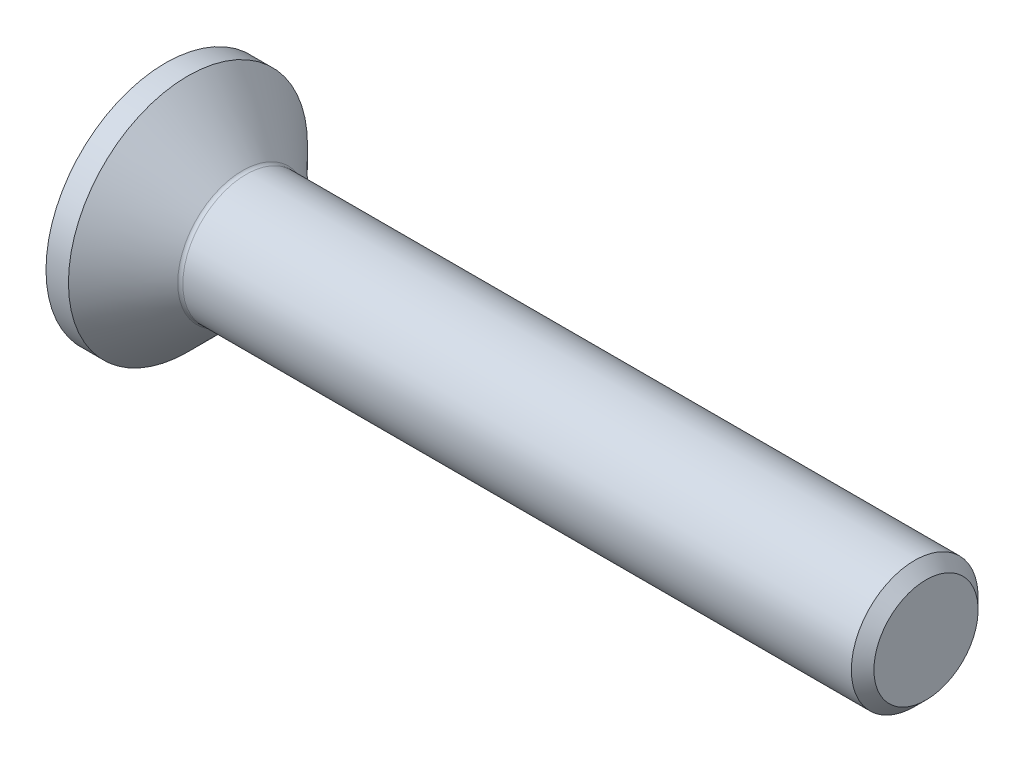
ISO-10303-21;
HEADER;
FILE_DESCRIPTION(('STEP AP214'),'2;1');
FILE_NAME('part.step','',(''),(''),'','','');
FILE_SCHEMA(('AUTOMOTIVE_DESIGN { 1 0 10303 214 1 1 1 1 }'));
ENDSEC;
DATA;
#1=APPLICATION_CONTEXT('core data for automotive mechanical design processes');
#2=APPLICATION_PROTOCOL_DEFINITION('international standard','automotive_design',2000,#1);
#3=PRODUCT_CONTEXT('',#1,'mechanical');
#4=PRODUCT('Part','Part','',(#3));
#5=PRODUCT_RELATED_PRODUCT_CATEGORY('part','',(#4));
#6=PRODUCT_DEFINITION_FORMATION('','',#4);
#7=PRODUCT_DEFINITION_CONTEXT('part definition',#1,'design');
#8=PRODUCT_DEFINITION('design','',#6,#7);
#9=PRODUCT_DEFINITION_SHAPE('','',#8);
#10=(LENGTH_UNIT() NAMED_UNIT(*) SI_UNIT(.MILLI.,.METRE.));
#11=(NAMED_UNIT(*) PLANE_ANGLE_UNIT() SI_UNIT($,.RADIAN.));
#12=(NAMED_UNIT(*) SI_UNIT($,.STERADIAN.) SOLID_ANGLE_UNIT());
#13=UNCERTAINTY_MEASURE_WITH_UNIT(LENGTH_MEASURE(1.E-05),#10,'distance_accuracy_value','');
#14=(GEOMETRIC_REPRESENTATION_CONTEXT(3) GLOBAL_UNCERTAINTY_ASSIGNED_CONTEXT((#13)) GLOBAL_UNIT_ASSIGNED_CONTEXT((#10,
#11,#12)) REPRESENTATION_CONTEXT('',''));
#15=CARTESIAN_POINT('',(0.,0.,0.));
#16=DIRECTION('',(0.,0.,1.));
#17=DIRECTION('',(1.,0.,0.));
#18=AXIS2_PLACEMENT_3D('',#15,#16,#17);
#19=CARTESIAN_POINT('',(0.,0.,0.));
#20=DIRECTION('',(-1.,0.,0.));
#21=DIRECTION('',(0.,0.,1.));
#22=AXIS2_PLACEMENT_3D('',#19,#20,#21);
#23=PLANE('',#22);
#24=CARTESIAN_POINT('',(0.,0.,0.));
#25=DIRECTION('',(-1.,0.,0.));
#26=DIRECTION('',(0.,0.,1.));
#27=AXIS2_PLACEMENT_3D('',#24,#25,#26);
#28=CIRCLE('',#27,4.715);
#29=CARTESIAN_POINT('',(0.,0.,4.715));
#30=VERTEX_POINT('',#29);
#31=EDGE_CURVE('E162',#30,#30,#28,.T.);
#32=ORIENTED_EDGE('',*,*,#31,.T.);
#33=EDGE_LOOP('',(#32));
#34=FACE_BOUND('',#33,.T.);
#35=DIRECTION('',(0.,-0.499999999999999,-0.866025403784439));
#36=VECTOR('',#35,1.);
#37=CARTESIAN_POINT('',(0.,-0.866025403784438,1.5));
#38=LINE('',#37,#36);
#39=CARTESIAN_POINT('',(0.,-0.866025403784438,1.5));
#40=VERTEX_POINT('',#39);
#41=CARTESIAN_POINT('',(0.,-1.73205080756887,0.));
#42=VERTEX_POINT('',#41);
#43=EDGE_CURVE('E128',#40,#42,#38,.T.);
#44=ORIENTED_EDGE('',*,*,#43,.T.);
#45=DIRECTION('',(0.,0.499999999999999,-0.866025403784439));
#46=VECTOR('',#45,1.);
#47=CARTESIAN_POINT('',(0.,-1.73205080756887,0.));
#48=LINE('',#47,#46);
#49=CARTESIAN_POINT('',(0.,-0.866025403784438,-1.5));
#50=VERTEX_POINT('',#49);
#51=EDGE_CURVE('E59',#42,#50,#48,.T.);
#52=ORIENTED_EDGE('',*,*,#51,.T.);
#53=DIRECTION('',(0.,1.,0.));
#54=VECTOR('',#53,1.);
#55=CARTESIAN_POINT('',(0.,-0.866025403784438,-1.5));
#56=LINE('',#55,#54);
#57=CARTESIAN_POINT('',(0.,0.866025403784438,-1.5));
#58=VERTEX_POINT('',#57);
#59=EDGE_CURVE('E139',#50,#58,#56,.T.);
#60=ORIENTED_EDGE('',*,*,#59,.T.);
#61=DIRECTION('',(0.,0.500000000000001,0.866025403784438));
#62=VECTOR('',#61,1.);
#63=CARTESIAN_POINT('',(0.,0.866025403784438,-1.5));
#64=LINE('',#63,#62);
#65=CARTESIAN_POINT('',(0.,1.73205080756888,0.));
#66=VERTEX_POINT('',#65);
#67=EDGE_CURVE('E263',#58,#66,#64,.T.);
#68=ORIENTED_EDGE('',*,*,#67,.T.);
#69=DIRECTION('',(0.,-0.5,0.866025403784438));
#70=VECTOR('',#69,1.);
#71=CARTESIAN_POINT('',(0.,1.73205080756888,0.));
#72=LINE('',#71,#70);
#73=CARTESIAN_POINT('',(0.,0.866025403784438,1.5));
#74=VERTEX_POINT('',#73);
#75=EDGE_CURVE('E266',#66,#74,#72,.T.);
#76=ORIENTED_EDGE('',*,*,#75,.T.);
#77=DIRECTION('',(0.,-1.,0.));
#78=VECTOR('',#77,1.);
#79=CARTESIAN_POINT('',(0.,0.866025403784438,1.5));
#80=LINE('',#79,#78);
#81=EDGE_CURVE('E269',#74,#40,#80,.T.);
#82=ORIENTED_EDGE('',*,*,#81,.T.);
#83=EDGE_LOOP('',(#44,#52,#60,#68,#76,#82));
#84=FACE_BOUND('',#83,.T.);
#85=ADVANCED_FACE('F44',(#34,#84),#23,.T.);
#86=CARTESIAN_POINT('',(0.,0.,0.));
#87=DIRECTION('',(-1.,0.,0.));
#88=DIRECTION('',(0.,0.,1.));
#89=AXIS2_PLACEMENT_3D('',#86,#87,#88);
#90=CYLINDRICAL_SURFACE('',#89,4.715);
#91=CARTESIAN_POINT('',(0.885000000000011,0.,0.));
#92=DIRECTION('',(-1.,0.,0.));
#93=DIRECTION('',(0.,0.,1.));
#94=AXIS2_PLACEMENT_3D('',#91,#92,#93);
#95=CIRCLE('',#94,4.715);
#96=CARTESIAN_POINT('',(0.885000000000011,0.,4.715));
#97=VERTEX_POINT('',#96);
#98=EDGE_CURVE('E159',#97,#97,#95,.T.);
#99=ORIENTED_EDGE('',*,*,#98,.T.);
#100=EDGE_LOOP('',(#99));
#101=FACE_BOUND('',#100,.T.);
#102=ORIENTED_EDGE('',*,*,#31,.F.);
#103=EDGE_LOOP('',(#102));
#104=FACE_BOUND('',#103,.T.);
#105=ADVANCED_FACE('F183',(#101,#104),#90,.T.);
#106=CARTESIAN_POINT('',(0.885000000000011,0.,0.));
#107=DIRECTION('',(-1.,0.,0.));
#108=DIRECTION('',(0.,0.,1.));
#109=AXIS2_PLACEMENT_3D('',#106,#107,#108);
#110=CONICAL_SURFACE('',#109,4.715,0.785398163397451);
#111=CARTESIAN_POINT('',(3.04142135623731,0.,0.));
#112=DIRECTION('',(-1.,0.,0.));
#113=DIRECTION('',(0.,0.,1.));
#114=AXIS2_PLACEMENT_3D('',#111,#112,#113);
#115=CIRCLE('',#114,2.55857864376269);
#116=CARTESIAN_POINT('',(3.04142135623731,0.,2.55857864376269));
#117=VERTEX_POINT('',#116);
#118=EDGE_CURVE('E52',#117,#117,#115,.T.);
#119=ORIENTED_EDGE('',*,*,#118,.T.);
#120=EDGE_LOOP('',(#119));
#121=FACE_BOUND('',#120,.T.);
#122=ORIENTED_EDGE('',*,*,#98,.F.);
#123=EDGE_LOOP('',(#122));
#124=FACE_BOUND('',#123,.T.);
#125=ADVANCED_FACE('F167',(#121,#124),#110,.T.);
#126=CARTESIAN_POINT('',(0.,0.,0.));
#127=DIRECTION('',(-1.,0.,0.));
#128=DIRECTION('',(0.,0.,1.));
#129=AXIS2_PLACEMENT_3D('',#126,#127,#128);
#130=CYLINDRICAL_SURFACE('',#129,2.5);
#131=CARTESIAN_POINT('',(3.18284271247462,0.,0.));
#132=DIRECTION('',(-1.,0.,0.));
#133=DIRECTION('',(0.,0.,1.));
#134=AXIS2_PLACEMENT_3D('',#131,#132,#133);
#135=CIRCLE('',#134,2.5);
#136=CARTESIAN_POINT('',(3.18284271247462,0.,2.5));
#137=VERTEX_POINT('',#136);
#138=EDGE_CURVE('E11',#137,#137,#135,.F.);
#139=ORIENTED_EDGE('',*,*,#138,.T.);
#140=EDGE_LOOP('',(#139));
#141=FACE_BOUND('',#140,.T.);
#142=CARTESIAN_POINT('',(29.555,0.,0.));
#143=DIRECTION('',(-1.,0.,0.));
#144=DIRECTION('',(0.,0.,1.));
#145=AXIS2_PLACEMENT_3D('',#142,#143,#144);
#146=CIRCLE('',#145,2.5);
#147=CARTESIAN_POINT('',(29.555,0.,2.5));
#148=VERTEX_POINT('',#147);
#149=EDGE_CURVE('E156',#148,#148,#146,.T.);
#150=ORIENTED_EDGE('',*,*,#149,.T.);
#151=EDGE_LOOP('',(#150));
#152=FACE_BOUND('',#151,.T.);
#153=ADVANCED_FACE('F194',(#141,#152),#130,.T.);
#154=CARTESIAN_POINT('',(30.,0.,0.));
#155=DIRECTION('',(-1.,0.,0.));
#156=DIRECTION('',(0.,0.,1.));
#157=AXIS2_PLACEMENT_3D('',#154,#155,#156);
#158=CONICAL_SURFACE('',#157,2.055,0.785398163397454);
#159=ORIENTED_EDGE('',*,*,#149,.F.);
#160=EDGE_LOOP('',(#159));
#161=FACE_BOUND('',#160,.T.);
#162=CARTESIAN_POINT('',(30.,0.,0.));
#163=DIRECTION('',(-1.,0.,0.));
#164=DIRECTION('',(0.,0.,1.));
#165=AXIS2_PLACEMENT_3D('',#162,#163,#164);
#166=CIRCLE('',#165,2.055);
#167=CARTESIAN_POINT('',(30.,0.,2.055));
#168=VERTEX_POINT('',#167);
#169=EDGE_CURVE('E152',#168,#168,#166,.T.);
#170=ORIENTED_EDGE('',*,*,#169,.T.);
#171=EDGE_LOOP('',(#170));
#172=FACE_BOUND('',#171,.T.);
#173=ADVANCED_FACE('F178',(#161,#172),#158,.T.);
#174=CARTESIAN_POINT('',(30.,2.055,0.));
#175=DIRECTION('',(1.,0.,0.));
#176=DIRECTION('',(0.,0.,-1.));
#177=AXIS2_PLACEMENT_3D('',#174,#175,#176);
#178=PLANE('',#177);
#179=ORIENTED_EDGE('',*,*,#169,.F.);
#180=EDGE_LOOP('',(#179));
#181=FACE_BOUND('',#180,.T.);
#182=ADVANCED_FACE('F171',(#181),#178,.T.);
#183=CARTESIAN_POINT('',(3.18284271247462,0.,0.));
#184=DIRECTION('',(-1.,0.,0.));
#185=DIRECTION('',(0.,0.,1.));
#186=AXIS2_PLACEMENT_3D('',#183,#184,#185);
#187=TOROIDAL_SURFACE('',#186,2.7,0.2);
#188=ORIENTED_EDGE('',*,*,#138,.F.);
#189=EDGE_LOOP('',(#188));
#190=FACE_BOUND('',#189,.T.);
#191=ORIENTED_EDGE('',*,*,#118,.F.);
#192=EDGE_LOOP('',(#191));
#193=FACE_BOUND('',#192,.T.);
#194=ADVANCED_FACE('F46',(#190,#193),#187,.F.);
#195=CARTESIAN_POINT('',(1.9,-1.73205080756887,0.));
#196=DIRECTION('',(0.,0.866025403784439,0.499999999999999));
#197=DIRECTION('',(0.,-0.499999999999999,0.866025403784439));
#198=AXIS2_PLACEMENT_3D('',#195,#196,#197);
#199=PLANE('',#198);
#200=ORIENTED_EDGE('',*,*,#51,.F.);
#201=DIRECTION('',(-1.,0.,0.));
#202=VECTOR('',#201,1.);
#203=CARTESIAN_POINT('',(1.9,-1.73205080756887,0.));
#204=LINE('',#203,#202);
#205=CARTESIAN_POINT('',(1.9,-1.73205080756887,0.));
#206=VERTEX_POINT('',#205);
#207=EDGE_CURVE('E260',#206,#42,#204,.T.);
#208=ORIENTED_EDGE('',*,*,#207,.F.);
#209=DIRECTION('',(0.,0.499999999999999,-0.866025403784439));
#210=VECTOR('',#209,1.);
#211=CARTESIAN_POINT('',(1.9,-1.73205080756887,0.));
#212=LINE('',#211,#210);
#213=CARTESIAN_POINT('',(1.9,-1.29903810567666,-0.749999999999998));
#214=VERTEX_POINT('',#213);
#215=EDGE_CURVE('E124',#206,#214,#212,.T.);
#216=ORIENTED_EDGE('',*,*,#215,.T.);
#217=CARTESIAN_POINT('',(1.9,-0.866025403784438,-1.5));
#218=VERTEX_POINT('',#217);
#219=EDGE_CURVE('E120',#214,#218,#212,.T.);
#220=ORIENTED_EDGE('',*,*,#219,.T.);
#221=DIRECTION('',(-1.,0.,0.));
#222=VECTOR('',#221,1.);
#223=CARTESIAN_POINT('',(1.9,-0.866025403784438,-1.5));
#224=LINE('',#223,#222);
#225=EDGE_CURVE('E122',#218,#50,#224,.T.);
#226=ORIENTED_EDGE('',*,*,#225,.T.);
#227=EDGE_LOOP('',(#200,#208,#216,#220,#226));
#228=FACE_BOUND('',#227,.T.);
#229=ADVANCED_FACE('F121',(#228),#199,.T.);
#230=CARTESIAN_POINT('',(1.9,-0.866025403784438,-1.5));
#231=DIRECTION('',(0.,0.,1.));
#232=DIRECTION('',(0.,-1.,0.));
#233=AXIS2_PLACEMENT_3D('',#230,#231,#232);
#234=PLANE('',#233);
#235=ORIENTED_EDGE('',*,*,#59,.F.);
#236=ORIENTED_EDGE('',*,*,#225,.F.);
#237=DIRECTION('',(0.,1.,0.));
#238=VECTOR('',#237,1.);
#239=CARTESIAN_POINT('',(1.9,-0.866025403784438,-1.5));
#240=LINE('',#239,#238);
#241=CARTESIAN_POINT('',(1.9,0.,-1.5));
#242=VERTEX_POINT('',#241);
#243=EDGE_CURVE('E67',#218,#242,#240,.T.);
#244=ORIENTED_EDGE('',*,*,#243,.T.);
#245=CARTESIAN_POINT('',(1.9,0.866025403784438,-1.5));
#246=VERTEX_POINT('',#245);
#247=EDGE_CURVE('E134',#242,#246,#240,.T.);
#248=ORIENTED_EDGE('',*,*,#247,.T.);
#249=DIRECTION('',(-1.,0.,0.));
#250=VECTOR('',#249,1.);
#251=CARTESIAN_POINT('',(1.9,0.866025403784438,-1.5));
#252=LINE('',#251,#250);
#253=EDGE_CURVE('E141',#246,#58,#252,.T.);
#254=ORIENTED_EDGE('',*,*,#253,.T.);
#255=EDGE_LOOP('',(#235,#236,#244,#248,#254));
#256=FACE_BOUND('',#255,.T.);
#257=ADVANCED_FACE('F136',(#256),#234,.T.);
#258=CARTESIAN_POINT('',(1.9,0.866025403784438,-1.5));
#259=DIRECTION('',(0.,-0.866025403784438,0.500000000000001));
#260=DIRECTION('',(0.,-0.500000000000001,-0.866025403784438));
#261=AXIS2_PLACEMENT_3D('',#258,#259,#260);
#262=PLANE('',#261);
#263=ORIENTED_EDGE('',*,*,#67,.F.);
#264=ORIENTED_EDGE('',*,*,#253,.F.);
#265=DIRECTION('',(0.,0.500000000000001,0.866025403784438));
#266=VECTOR('',#265,1.);
#267=CARTESIAN_POINT('',(1.9,0.866025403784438,-1.5));
#268=LINE('',#267,#266);
#269=CARTESIAN_POINT('',(1.9,1.29903810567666,-0.750000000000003));
#270=VERTEX_POINT('',#269);
#271=EDGE_CURVE('E241',#246,#270,#268,.T.);
#272=ORIENTED_EDGE('',*,*,#271,.T.);
#273=CARTESIAN_POINT('',(1.9,1.73205080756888,0.));
#274=VERTEX_POINT('',#273);
#275=EDGE_CURVE('E133',#270,#274,#268,.T.);
#276=ORIENTED_EDGE('',*,*,#275,.T.);
#277=DIRECTION('',(-1.,0.,0.));
#278=VECTOR('',#277,1.);
#279=CARTESIAN_POINT('',(1.9,1.73205080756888,0.));
#280=LINE('',#279,#278);
#281=EDGE_CURVE('E147',#274,#66,#280,.T.);
#282=ORIENTED_EDGE('',*,*,#281,.T.);
#283=EDGE_LOOP('',(#263,#264,#272,#276,#282));
#284=FACE_BOUND('',#283,.T.);
#285=ADVANCED_FACE('F208',(#284),#262,.T.);
#286=CARTESIAN_POINT('',(1.9,1.73205080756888,0.));
#287=DIRECTION('',(0.,-0.866025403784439,-0.5));
#288=DIRECTION('',(0.,0.5,-0.866025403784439));
#289=AXIS2_PLACEMENT_3D('',#286,#287,#288);
#290=PLANE('',#289);
#291=ORIENTED_EDGE('',*,*,#75,.F.);
#292=ORIENTED_EDGE('',*,*,#281,.F.);
#293=DIRECTION('',(0.,-0.5,0.866025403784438));
#294=VECTOR('',#293,1.);
#295=CARTESIAN_POINT('',(1.9,1.73205080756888,0.));
#296=LINE('',#295,#294);
#297=CARTESIAN_POINT('',(1.9,1.29903810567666,0.750000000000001));
#298=VERTEX_POINT('',#297);
#299=EDGE_CURVE('E248',#274,#298,#296,.T.);
#300=ORIENTED_EDGE('',*,*,#299,.T.);
#301=CARTESIAN_POINT('',(1.9,0.866025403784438,1.5));
#302=VERTEX_POINT('',#301);
#303=EDGE_CURVE('E246',#298,#302,#296,.T.);
#304=ORIENTED_EDGE('',*,*,#303,.T.);
#305=DIRECTION('',(-1.,0.,0.));
#306=VECTOR('',#305,1.);
#307=CARTESIAN_POINT('',(1.9,0.866025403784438,1.5));
#308=LINE('',#307,#306);
#309=EDGE_CURVE('E278',#302,#74,#308,.T.);
#310=ORIENTED_EDGE('',*,*,#309,.T.);
#311=EDGE_LOOP('',(#291,#292,#300,#304,#310));
#312=FACE_BOUND('',#311,.T.);
#313=ADVANCED_FACE('F211',(#312),#290,.T.);
#314=CARTESIAN_POINT('',(1.9,0.866025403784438,1.5));
#315=DIRECTION('',(0.,0.,-1.));
#316=DIRECTION('',(0.,1.,0.));
#317=AXIS2_PLACEMENT_3D('',#314,#315,#316);
#318=PLANE('',#317);
#319=ORIENTED_EDGE('',*,*,#81,.F.);
#320=ORIENTED_EDGE('',*,*,#309,.F.);
#321=DIRECTION('',(0.,-1.,0.));
#322=VECTOR('',#321,1.);
#323=CARTESIAN_POINT('',(1.9,0.866025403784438,1.5));
#324=LINE('',#323,#322);
#325=CARTESIAN_POINT('',(1.9,0.,1.5));
#326=VERTEX_POINT('',#325);
#327=EDGE_CURVE('E253',#302,#326,#324,.T.);
#328=ORIENTED_EDGE('',*,*,#327,.T.);
#329=CARTESIAN_POINT('',(1.9,-0.866025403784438,1.5));
#330=VERTEX_POINT('',#329);
#331=EDGE_CURVE('E252',#326,#330,#324,.T.);
#332=ORIENTED_EDGE('',*,*,#331,.T.);
#333=DIRECTION('',(-1.,0.,0.));
#334=VECTOR('',#333,1.);
#335=CARTESIAN_POINT('',(1.9,-0.866025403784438,1.5));
#336=LINE('',#335,#334);
#337=EDGE_CURVE('E275',#330,#40,#336,.T.);
#338=ORIENTED_EDGE('',*,*,#337,.T.);
#339=EDGE_LOOP('',(#319,#320,#328,#332,#338));
#340=FACE_BOUND('',#339,.T.);
#341=ADVANCED_FACE('F215',(#340),#318,.T.);
#342=CARTESIAN_POINT('',(1.9,-0.866025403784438,1.5));
#343=DIRECTION('',(0.,0.866025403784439,-0.499999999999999));
#344=DIRECTION('',(0.,0.499999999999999,0.866025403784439));
#345=AXIS2_PLACEMENT_3D('',#342,#343,#344);
#346=PLANE('',#345);
#347=ORIENTED_EDGE('',*,*,#43,.F.);
#348=ORIENTED_EDGE('',*,*,#337,.F.);
#349=DIRECTION('',(0.,-0.499999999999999,-0.866025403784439));
#350=VECTOR('',#349,1.);
#351=CARTESIAN_POINT('',(1.9,-0.866025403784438,1.5));
#352=LINE('',#351,#350);
#353=CARTESIAN_POINT('',(1.9,-1.29903810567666,0.749999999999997));
#354=VERTEX_POINT('',#353);
#355=EDGE_CURVE('E257',#330,#354,#352,.T.);
#356=ORIENTED_EDGE('',*,*,#355,.T.);
#357=EDGE_CURVE('E256',#354,#206,#352,.T.);
#358=ORIENTED_EDGE('',*,*,#357,.T.);
#359=ORIENTED_EDGE('',*,*,#207,.T.);
#360=EDGE_LOOP('',(#347,#348,#356,#358,#359));
#361=FACE_BOUND('',#360,.T.);
#362=ADVANCED_FACE('F219',(#361),#346,.T.);
#363=CARTESIAN_POINT('',(1.9,-0.866025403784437,-1.5));
#364=DIRECTION('',(1.,0.,0.));
#365=DIRECTION('',(0.,0.,-1.));
#366=AXIS2_PLACEMENT_3D('',#363,#364,#365);
#367=PLANE('',#366);
#368=ORIENTED_EDGE('',*,*,#243,.F.);
#369=ORIENTED_EDGE('',*,*,#219,.F.);
#370=CARTESIAN_POINT('',(1.9,0.,0.));
#371=DIRECTION('',(-1.,0.,0.));
#372=DIRECTION('',(0.,0.,1.));
#373=AXIS2_PLACEMENT_3D('',#370,#371,#372);
#374=CIRCLE('',#373,1.5);
#375=EDGE_CURVE('E131',#242,#214,#374,.T.);
#376=ORIENTED_EDGE('',*,*,#375,.F.);
#377=EDGE_LOOP('',(#368,#369,#376));
#378=FACE_BOUND('',#377,.T.);
#379=ADVANCED_FACE('F130',(#378),#367,.F.);
#380=ORIENTED_EDGE('',*,*,#215,.F.);
#381=ORIENTED_EDGE('',*,*,#357,.F.);
#382=EDGE_CURVE('E144',#214,#354,#374,.T.);
#383=ORIENTED_EDGE('',*,*,#382,.F.);
#384=EDGE_LOOP('',(#380,#381,#383));
#385=FACE_BOUND('',#384,.T.);
#386=ADVANCED_FACE('F225',(#385),#367,.F.);
#387=ORIENTED_EDGE('',*,*,#355,.F.);
#388=ORIENTED_EDGE('',*,*,#331,.F.);
#389=EDGE_CURVE('E140',#354,#326,#374,.T.);
#390=ORIENTED_EDGE('',*,*,#389,.F.);
#391=EDGE_LOOP('',(#387,#388,#390));
#392=FACE_BOUND('',#391,.T.);
#393=ADVANCED_FACE('F229',(#392),#367,.F.);
#394=ORIENTED_EDGE('',*,*,#327,.F.);
#395=ORIENTED_EDGE('',*,*,#303,.F.);
#396=EDGE_CURVE('E146',#326,#298,#374,.T.);
#397=ORIENTED_EDGE('',*,*,#396,.F.);
#398=EDGE_LOOP('',(#394,#395,#397));
#399=FACE_BOUND('',#398,.T.);
#400=ADVANCED_FACE('F237',(#399),#367,.F.);
#401=ORIENTED_EDGE('',*,*,#299,.F.);
#402=ORIENTED_EDGE('',*,*,#275,.F.);
#403=EDGE_CURVE('E153',#298,#270,#374,.T.);
#404=ORIENTED_EDGE('',*,*,#403,.F.);
#405=EDGE_LOOP('',(#401,#402,#404));
#406=FACE_BOUND('',#405,.T.);
#407=ADVANCED_FACE('F232',(#406),#367,.F.);
#408=ORIENTED_EDGE('',*,*,#271,.F.);
#409=ORIENTED_EDGE('',*,*,#247,.F.);
#410=EDGE_CURVE('E242',#270,#242,#374,.T.);
#411=ORIENTED_EDGE('',*,*,#410,.F.);
#412=EDGE_LOOP('',(#408,#409,#411));
#413=FACE_BOUND('',#412,.T.);
#414=ADVANCED_FACE('F203',(#413),#367,.F.);
#415=CARTESIAN_POINT('',(1.9,0.,0.));
#416=DIRECTION('',(-1.,0.,0.));
#417=DIRECTION('',(0.,0.,1.));
#418=AXIS2_PLACEMENT_3D('',#415,#416,#417);
#419=CONICAL_SURFACE('',#418,1.5,1.04719755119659);
#420=CARTESIAN_POINT('',(2.76602540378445,0.,0.));
#421=VERTEX_POINT('',#420);
#422=VERTEX_LOOP('',#421);
#423=FACE_BOUND('',#422,.T.);
#424=ORIENTED_EDGE('',*,*,#396,.T.);
#425=ORIENTED_EDGE('',*,*,#403,.T.);
#426=ORIENTED_EDGE('',*,*,#410,.T.);
#427=ORIENTED_EDGE('',*,*,#375,.T.);
#428=ORIENTED_EDGE('',*,*,#382,.T.);
#429=ORIENTED_EDGE('',*,*,#389,.T.);
#430=EDGE_LOOP('',(#424,#425,#426,#427,#428,#429));
#431=FACE_BOUND('',#430,.T.);
#432=ADVANCED_FACE('F201',(#423,#431),#419,.F.);
#433=CLOSED_SHELL('',(#85,#105,#125,#153,#173,#182,#194,#229,#257,#285,#313,#341,#362,#379,#386,
#393,#400,#407,#414,#432));
#434=MANIFOLD_SOLID_BREP('B2',#433);
#435=ADVANCED_BREP_SHAPE_REPRESENTATION('',(#18,#434),#14);
#436=SHAPE_DEFINITION_REPRESENTATION(#9,#435);
ENDSEC;
END-ISO-10303-21;
